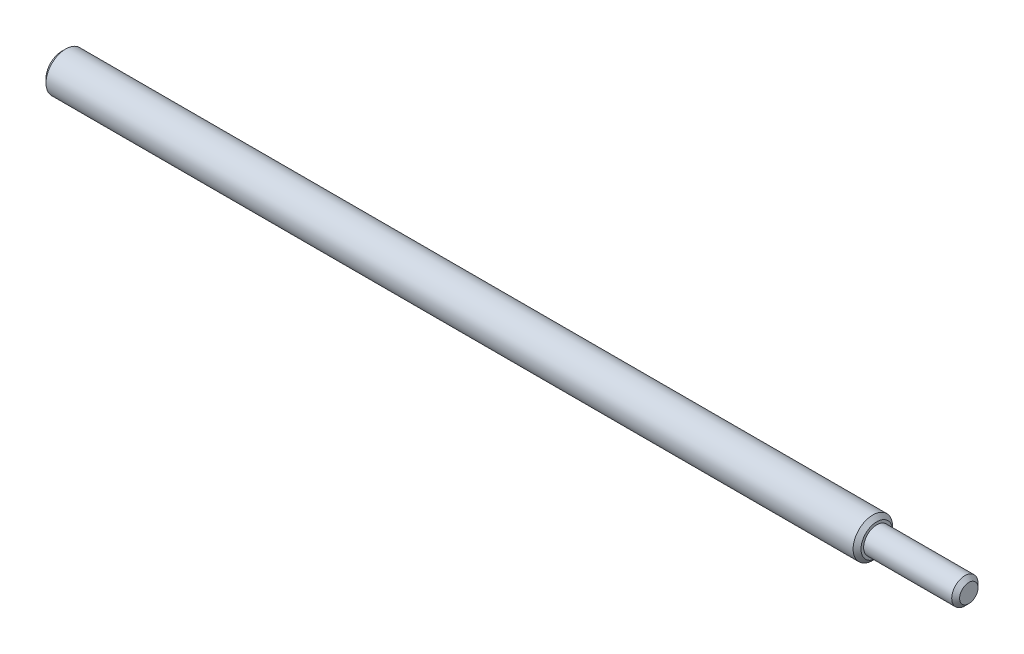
from build123d import *

# Parameters (mm, degrees)
CHANFREIN1_SIZE = 0.6


with BuildPart() as part:
    # Esquisse1 → R_volution1 (revolve)
    with BuildSketch(Plane.XY, mode=Mode.PRIVATE) as r_volution1_sk:
        Polygon((0, 0), (0, 3), (124, 3), (124, 2), (138, 2), (138, 0), align=None)
    revolve(r_volution1_sk.sketch.rotate(Axis((0, 0, 0), (1, 0, 0)), 90), axis=Axis((0, 0, 0), (1, 0, 0)))

    # Chanfrein1
    chanfrein1_edges = [part.edges().sort_by_distance(p)[0] for p in [
        (138, 0, -2),
        (124, 0, -3),
        (0, 0, -3),
    ]]
    chamfer(chanfrein1_edges, length=CHANFREIN1_SIZE)


solid = part.part
